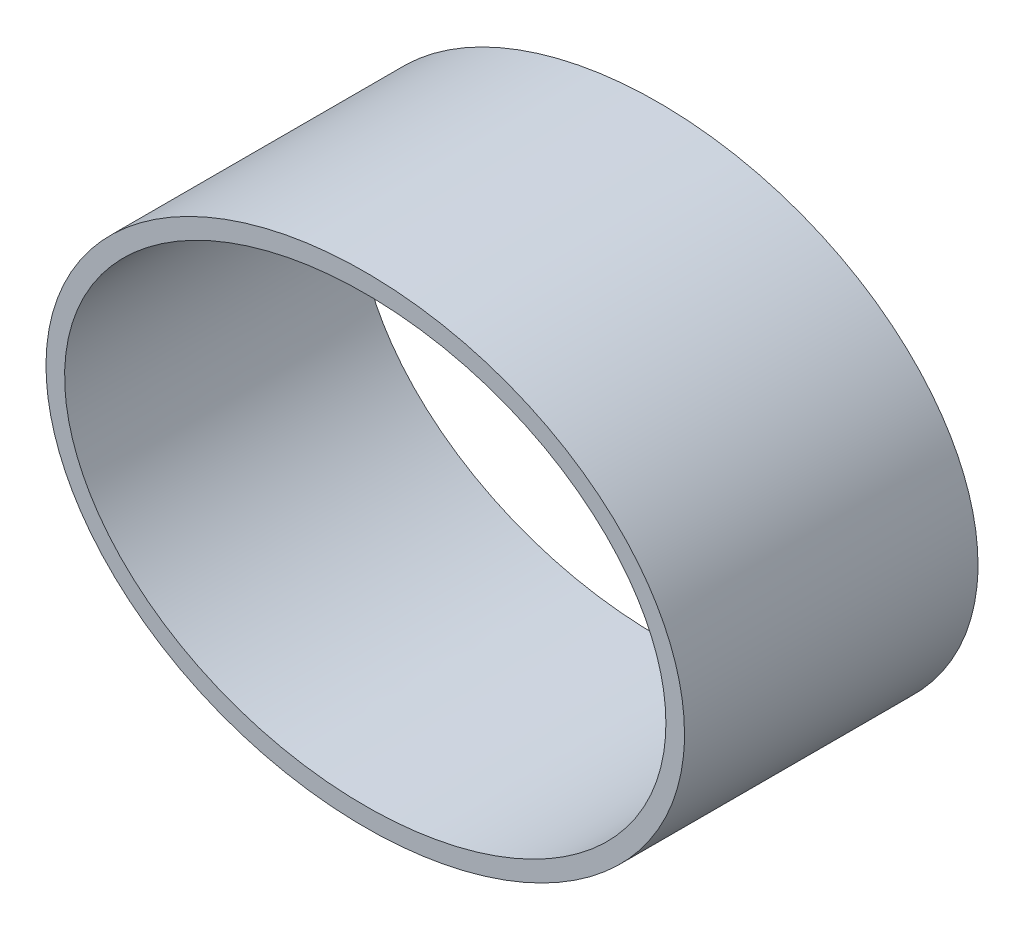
ISO-10303-21;
HEADER;
FILE_DESCRIPTION(('STEP AP214'),'2;1');
FILE_NAME('part.step','',(''),(''),'','','');
FILE_SCHEMA(('AUTOMOTIVE_DESIGN { 1 0 10303 214 1 1 1 1 }'));
ENDSEC;
DATA;
#1=APPLICATION_CONTEXT('core data for automotive mechanical design processes');
#2=APPLICATION_PROTOCOL_DEFINITION('international standard','automotive_design',2000,#1);
#3=PRODUCT_CONTEXT('',#1,'mechanical');
#4=PRODUCT('Part','Part','',(#3));
#5=PRODUCT_RELATED_PRODUCT_CATEGORY('part','',(#4));
#6=PRODUCT_DEFINITION_FORMATION('','',#4);
#7=PRODUCT_DEFINITION_CONTEXT('part definition',#1,'design');
#8=PRODUCT_DEFINITION('design','',#6,#7);
#9=PRODUCT_DEFINITION_SHAPE('','',#8);
#10=(LENGTH_UNIT() NAMED_UNIT(*) SI_UNIT(.MILLI.,.METRE.));
#11=(NAMED_UNIT(*) PLANE_ANGLE_UNIT() SI_UNIT($,.RADIAN.));
#12=(NAMED_UNIT(*) SI_UNIT($,.STERADIAN.) SOLID_ANGLE_UNIT());
#13=UNCERTAINTY_MEASURE_WITH_UNIT(LENGTH_MEASURE(1.E-05),#10,'distance_accuracy_value','');
#14=(GEOMETRIC_REPRESENTATION_CONTEXT(3) GLOBAL_UNCERTAINTY_ASSIGNED_CONTEXT((#13)) GLOBAL_UNIT_ASSIGNED_CONTEXT((#10,
#11,#12)) REPRESENTATION_CONTEXT('',''));
#15=CARTESIAN_POINT('',(0.,0.,0.));
#16=DIRECTION('',(0.,0.,1.));
#17=DIRECTION('',(1.,0.,0.));
#18=AXIS2_PLACEMENT_3D('',#15,#16,#17);
#19=CARTESIAN_POINT('',(42.,-51.,-233.5));
#20=CARTESIAN_POINT('',(42.,-20.,-233.5));
#21=CARTESIAN_POINT('',(0.,-20.,-233.5));
#22=CARTESIAN_POINT('',(-42.,-20.,-233.5));
#23=CARTESIAN_POINT('',(-42.,-51.,-233.5));
#24=CARTESIAN_POINT('',(-42.,-82.,-233.5));
#25=CARTESIAN_POINT('',(0.,-82.,-233.5));
#26=CARTESIAN_POINT('',(42.,-82.,-233.5));
#27=CARTESIAN_POINT('',(42.,-51.,-233.5));
#28=(BOUNDED_CURVE() B_SPLINE_CURVE(2,(#19,#20,#21,#22,#23,#24,#25,#26,#27),.UNSPECIFIED.,.T.,
.F.) B_SPLINE_CURVE_WITH_KNOTS((3,2,2,2,3),(0.,1.5707963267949,3.14159265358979,
4.71238898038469,6.28318530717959),
.UNSPECIFIED.) CURVE() GEOMETRIC_REPRESENTATION_ITEM() RATIONAL_B_SPLINE_CURVE((1.,
0.707106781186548,1.,0.707106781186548,1.,0.707106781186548,1.,0.707106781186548,1.)) REPRESENTATION_ITEM(''));
#29=DIRECTION('',(0.,0.,-1.));
#30=VECTOR('',#29,1.);
#31=SURFACE_OF_LINEAR_EXTRUSION('',#28,#30);
#32=CARTESIAN_POINT('',(42.,-51.,-192.5));
#33=CARTESIAN_POINT('',(42.,-20.,-192.5));
#34=CARTESIAN_POINT('',(0.,-20.,-192.5));
#35=CARTESIAN_POINT('',(-42.,-20.,-192.5));
#36=CARTESIAN_POINT('',(-42.,-51.,-192.5));
#37=CARTESIAN_POINT('',(-42.,-82.,-192.5));
#38=CARTESIAN_POINT('',(0.,-82.,-192.5));
#39=CARTESIAN_POINT('',(42.,-82.,-192.5));
#40=CARTESIAN_POINT('',(42.,-51.,-192.5));
#41=(BOUNDED_CURVE() B_SPLINE_CURVE(2,(#32,#33,#34,#35,#36,#37,#38,#39,#40),.UNSPECIFIED.,.T.,
.F.) B_SPLINE_CURVE_WITH_KNOTS((3,2,2,2,3),(0.,1.5707963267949,3.14159265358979,
4.71238898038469,6.28318530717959),
.UNSPECIFIED.) CURVE() GEOMETRIC_REPRESENTATION_ITEM() RATIONAL_B_SPLINE_CURVE((1.,
0.707106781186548,1.,0.707106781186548,1.,0.707106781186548,1.,0.707106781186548,1.)) REPRESENTATION_ITEM(''));
#42=CARTESIAN_POINT('',(42.,-51.,-192.5));
#43=VERTEX_POINT('',#42);
#44=EDGE_CURVE('E18',#43,#43,#41,.F.);
#45=ORIENTED_EDGE('',*,*,#44,.F.);
#46=EDGE_LOOP('',(#45));
#47=FACE_BOUND('',#46,.T.);
#48=CARTESIAN_POINT('',(42.,-51.,-233.5));
#49=CARTESIAN_POINT('',(42.,-20.,-233.5));
#50=CARTESIAN_POINT('',(0.,-20.,-233.5));
#51=CARTESIAN_POINT('',(-42.,-20.,-233.5));
#52=CARTESIAN_POINT('',(-42.,-51.,-233.5));
#53=CARTESIAN_POINT('',(-42.,-82.,-233.5));
#54=CARTESIAN_POINT('',(0.,-82.,-233.5));
#55=CARTESIAN_POINT('',(42.,-82.,-233.5));
#56=CARTESIAN_POINT('',(42.,-51.,-233.5));
#57=(BOUNDED_CURVE() B_SPLINE_CURVE(2,(#48,#49,#50,#51,#52,#53,#54,#55,#56),.UNSPECIFIED.,.T.,
.F.) B_SPLINE_CURVE_WITH_KNOTS((3,2,2,2,3),(0.,1.5707963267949,3.14159265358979,
4.71238898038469,6.28318530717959),
.UNSPECIFIED.) CURVE() GEOMETRIC_REPRESENTATION_ITEM() RATIONAL_B_SPLINE_CURVE((1.,
0.707106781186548,1.,0.707106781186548,1.,0.707106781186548,1.,0.707106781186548,1.)) REPRESENTATION_ITEM(''));
#58=CARTESIAN_POINT('',(42.,-51.,-233.5));
#59=VERTEX_POINT('',#58);
#60=EDGE_CURVE('E29',#59,#59,#57,.F.);
#61=ORIENTED_EDGE('',*,*,#60,.T.);
#62=EDGE_LOOP('',(#61));
#63=FACE_BOUND('',#62,.T.);
#64=ADVANCED_FACE('F14',(#47,#63),#31,.T.);
#65=CARTESIAN_POINT('',(1.612351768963,-51.,-192.5));
#66=DIRECTION('',(0.,0.,1.));
#67=DIRECTION('',(1.,0.,0.));
#68=AXIS2_PLACEMENT_3D('',#65,#66,#67);
#69=PLANE('',#68);
#70=ORIENTED_EDGE('',*,*,#44,.T.);
#71=EDGE_LOOP('',(#70));
#72=FACE_BOUND('',#71,.T.);
#73=CARTESIAN_POINT('',(44.6,-51.,-192.5));
#74=CARTESIAN_POINT('',(44.6,-17.4,-192.5));
#75=CARTESIAN_POINT('',(0.,-17.4,-192.5));
#76=CARTESIAN_POINT('',(-44.6,-17.4,-192.5));
#77=CARTESIAN_POINT('',(-44.6,-51.,-192.5));
#78=CARTESIAN_POINT('',(-44.6,-84.6,-192.5));
#79=CARTESIAN_POINT('',(0.,-84.6,-192.5));
#80=CARTESIAN_POINT('',(44.6,-84.6,-192.5));
#81=CARTESIAN_POINT('',(44.6,-51.,-192.5));
#82=(BOUNDED_CURVE() B_SPLINE_CURVE(2,(#73,#74,#75,#76,#77,#78,#79,#80,#81),.UNSPECIFIED.,.T.,
.F.) B_SPLINE_CURVE_WITH_KNOTS((3,2,2,2,3),(0.,1.5707963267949,3.14159265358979,
4.71238898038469,6.28318530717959),
.UNSPECIFIED.) CURVE() GEOMETRIC_REPRESENTATION_ITEM() RATIONAL_B_SPLINE_CURVE((1.,
0.707106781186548,1.,0.707106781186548,1.,0.707106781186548,1.,0.707106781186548,1.)) REPRESENTATION_ITEM(''));
#83=CARTESIAN_POINT('',(44.6,-51.,-192.5));
#84=VERTEX_POINT('',#83);
#85=EDGE_CURVE('E24',#84,#84,#82,.T.);
#86=ORIENTED_EDGE('',*,*,#85,.T.);
#87=EDGE_LOOP('',(#86));
#88=FACE_BOUND('',#87,.T.);
#89=ADVANCED_FACE('F56',(#72,#88),#69,.T.);
#90=CARTESIAN_POINT('',(1.612351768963,-51.,-233.5));
#91=DIRECTION('',(0.,0.,1.));
#92=DIRECTION('',(1.,0.,0.));
#93=AXIS2_PLACEMENT_3D('',#90,#91,#92);
#94=PLANE('',#93);
#95=ORIENTED_EDGE('',*,*,#60,.F.);
#96=EDGE_LOOP('',(#95));
#97=FACE_BOUND('',#96,.T.);
#98=CARTESIAN_POINT('',(44.6,-51.,-233.5));
#99=CARTESIAN_POINT('',(44.6,-17.4,-233.5));
#100=CARTESIAN_POINT('',(0.,-17.4,-233.5));
#101=CARTESIAN_POINT('',(-44.6,-17.4,-233.5));
#102=CARTESIAN_POINT('',(-44.6,-51.,-233.5));
#103=CARTESIAN_POINT('',(-44.6,-84.6,-233.5));
#104=CARTESIAN_POINT('',(0.,-84.6,-233.5));
#105=CARTESIAN_POINT('',(44.6,-84.6,-233.5));
#106=CARTESIAN_POINT('',(44.6,-51.,-233.5));
#107=(BOUNDED_CURVE() B_SPLINE_CURVE(2,(#98,#99,#100,#101,#102,#103,#104,#105,#106),
.UNSPECIFIED.,.T.,.F.) B_SPLINE_CURVE_WITH_KNOTS((3,2,2,2,3),(0.,1.5707963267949,
3.14159265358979,4.71238898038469,6.28318530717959),
.UNSPECIFIED.) CURVE() GEOMETRIC_REPRESENTATION_ITEM() RATIONAL_B_SPLINE_CURVE((1.,
0.707106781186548,1.,0.707106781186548,1.,0.707106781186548,1.,0.707106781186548,1.)) REPRESENTATION_ITEM(''));
#108=CARTESIAN_POINT('',(44.6,-51.,-233.5));
#109=VERTEX_POINT('',#108);
#110=EDGE_CURVE('E9',#109,#109,#107,.F.);
#111=ORIENTED_EDGE('',*,*,#110,.T.);
#112=EDGE_LOOP('',(#111));
#113=FACE_BOUND('',#112,.T.);
#114=ADVANCED_FACE('F64',(#97,#113),#94,.F.);
#115=CARTESIAN_POINT('',(44.6,-51.,-233.5));
#116=CARTESIAN_POINT('',(44.6,-17.4,-233.5));
#117=CARTESIAN_POINT('',(0.,-17.4,-233.5));
#118=CARTESIAN_POINT('',(-44.6,-17.4,-233.5));
#119=CARTESIAN_POINT('',(-44.6,-51.,-233.5));
#120=CARTESIAN_POINT('',(-44.6,-84.6,-233.5));
#121=CARTESIAN_POINT('',(0.,-84.6,-233.5));
#122=CARTESIAN_POINT('',(44.6,-84.6,-233.5));
#123=CARTESIAN_POINT('',(44.6,-51.,-233.5));
#124=(BOUNDED_CURVE() B_SPLINE_CURVE(2,(#115,#116,#117,#118,#119,#120,#121,#122,#123),
.UNSPECIFIED.,.T.,.F.) B_SPLINE_CURVE_WITH_KNOTS((3,2,2,2,3),(0.,1.5707963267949,
3.14159265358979,4.71238898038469,6.28318530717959),
.UNSPECIFIED.) CURVE() GEOMETRIC_REPRESENTATION_ITEM() RATIONAL_B_SPLINE_CURVE((1.,
0.707106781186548,1.,0.707106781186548,1.,0.707106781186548,1.,0.707106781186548,1.)) REPRESENTATION_ITEM(''));
#125=DIRECTION('',(0.,0.,-1.));
#126=VECTOR('',#125,1.);
#127=SURFACE_OF_LINEAR_EXTRUSION('',#124,#126);
#128=ORIENTED_EDGE('',*,*,#85,.F.);
#129=EDGE_LOOP('',(#128));
#130=FACE_BOUND('',#129,.T.);
#131=ORIENTED_EDGE('',*,*,#110,.F.);
#132=EDGE_LOOP('',(#131));
#133=FACE_BOUND('',#132,.T.);
#134=ADVANCED_FACE('F65',(#130,#133),#127,.F.);
#135=CLOSED_SHELL('',(#64,#89,#114,#134));
#136=MANIFOLD_SOLID_BREP('B1',#135);
#137=ADVANCED_BREP_SHAPE_REPRESENTATION('',(#18,#136),#14);
#138=SHAPE_DEFINITION_REPRESENTATION(#9,#137);
ENDSEC;
END-ISO-10303-21;
